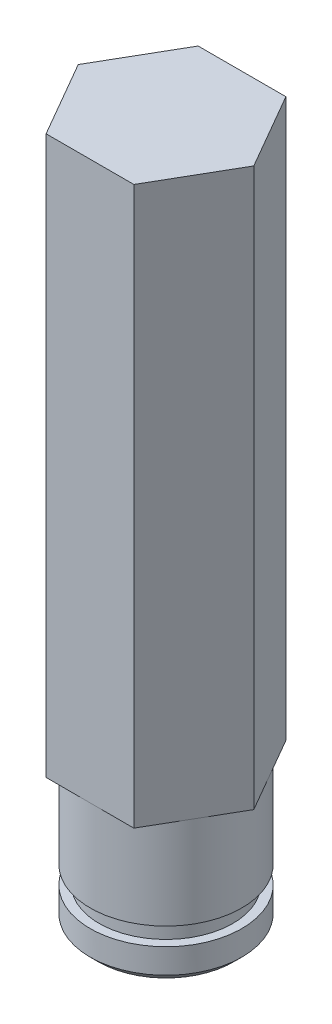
ISO-10303-21;
HEADER;
FILE_DESCRIPTION(('STEP AP214'),'2;1');
FILE_NAME('part.step','',(''),(''),'','','');
FILE_SCHEMA(('AUTOMOTIVE_DESIGN { 1 0 10303 214 1 1 1 1 }'));
ENDSEC;
DATA;
#1=APPLICATION_CONTEXT('core data for automotive mechanical design processes');
#2=APPLICATION_PROTOCOL_DEFINITION('international standard','automotive_design',2000,#1);
#3=PRODUCT_CONTEXT('',#1,'mechanical');
#4=PRODUCT('Part','Part','',(#3));
#5=PRODUCT_RELATED_PRODUCT_CATEGORY('part','',(#4));
#6=PRODUCT_DEFINITION_FORMATION('','',#4);
#7=PRODUCT_DEFINITION_CONTEXT('part definition',#1,'design');
#8=PRODUCT_DEFINITION('design','',#6,#7);
#9=PRODUCT_DEFINITION_SHAPE('','',#8);
#10=(LENGTH_UNIT() NAMED_UNIT(*) SI_UNIT(.MILLI.,.METRE.));
#11=(NAMED_UNIT(*) PLANE_ANGLE_UNIT() SI_UNIT($,.RADIAN.));
#12=(NAMED_UNIT(*) SI_UNIT($,.STERADIAN.) SOLID_ANGLE_UNIT());
#13=UNCERTAINTY_MEASURE_WITH_UNIT(LENGTH_MEASURE(1.E-05),#10,'distance_accuracy_value','');
#14=(GEOMETRIC_REPRESENTATION_CONTEXT(3) GLOBAL_UNCERTAINTY_ASSIGNED_CONTEXT((#13)) GLOBAL_UNIT_ASSIGNED_CONTEXT((#10,
#11,#12)) REPRESENTATION_CONTEXT('',''));
#15=CARTESIAN_POINT('',(0.,0.,0.));
#16=DIRECTION('',(0.,0.,1.));
#17=DIRECTION('',(1.,0.,0.));
#18=AXIS2_PLACEMENT_3D('',#15,#16,#17);
#19=CARTESIAN_POINT('',(-39.2241243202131,-43.815,-16.6661167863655));
#20=DIRECTION('',(0.,1.,0.));
#21=DIRECTION('',(0.,0.,1.));
#22=AXIS2_PLACEMENT_3D('',#19,#20,#21);
#23=PLANE('',#22);
#24=CARTESIAN_POINT('',(-39.2241243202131,-43.8149999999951,-16.6661167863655));
#25=DIRECTION('',(0.,1.,0.));
#26=DIRECTION('',(0.,0.,1.));
#27=AXIS2_PLACEMENT_3D('',#24,#25,#26);
#28=CIRCLE('',#27,4.24180000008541);
#29=CARTESIAN_POINT('',(-39.2241243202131,-43.8149999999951,-12.4243167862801));
#30=VERTEX_POINT('',#29);
#31=EDGE_CURVE('E20',#30,#30,#28,.T.);
#32=ORIENTED_EDGE('',*,*,#31,.F.);
#33=EDGE_LOOP('',(#32));
#34=FACE_BOUND('',#33,.T.);
#35=ADVANCED_FACE('F17',(#34),#23,.F.);
#36=CARTESIAN_POINT('',(-39.2241243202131,-43.3070000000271,-16.6661167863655));
#37=DIRECTION('',(0.,1.,0.));
#38=DIRECTION('',(0.,0.,1.));
#39=AXIS2_PLACEMENT_3D('',#36,#37,#38);
#40=CONICAL_SURFACE('',#39,4.74980000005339,0.785398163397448);
#41=CARTESIAN_POINT('',(-39.2241243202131,-43.307,-16.6661167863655));
#42=DIRECTION('',(0.,-1.,0.));
#43=DIRECTION('',(0.,0.,-1.));
#44=AXIS2_PLACEMENT_3D('',#41,#42,#43);
#45=CIRCLE('',#44,4.7498);
#46=CARTESIAN_POINT('',(-39.2241243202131,-43.307,-21.4159167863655));
#47=VERTEX_POINT('',#46);
#48=EDGE_CURVE('E98',#47,#47,#45,.F.);
#49=ORIENTED_EDGE('',*,*,#48,.F.);
#50=EDGE_LOOP('',(#49));
#51=FACE_BOUND('',#50,.T.);
#52=ORIENTED_EDGE('',*,*,#31,.T.);
#53=EDGE_LOOP('',(#52));
#54=FACE_BOUND('',#53,.T.);
#55=ADVANCED_FACE('F123',(#51,#54),#40,.T.);
#56=CARTESIAN_POINT('',(-39.2241243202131,-43.815,-16.6661167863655));
#57=DIRECTION('',(0.,-1.,0.));
#58=DIRECTION('',(0.,0.,-1.));
#59=AXIS2_PLACEMENT_3D('',#56,#57,#58);
#60=CYLINDRICAL_SURFACE('',#59,4.7498);
#61=CARTESIAN_POINT('',(-39.2241243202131,-41.7576,-16.6661167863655));
#62=DIRECTION('',(0.,-1.,0.));
#63=DIRECTION('',(0.,0.,-1.));
#64=AXIS2_PLACEMENT_3D('',#61,#62,#63);
#65=CIRCLE('',#64,4.7498);
#66=CARTESIAN_POINT('',(-39.2241243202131,-41.7576,-21.4159167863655));
#67=VERTEX_POINT('',#66);
#68=EDGE_CURVE('E101',#67,#67,#65,.F.);
#69=ORIENTED_EDGE('',*,*,#68,.F.);
#70=EDGE_LOOP('',(#69));
#71=FACE_BOUND('',#70,.T.);
#72=ORIENTED_EDGE('',*,*,#48,.T.);
#73=EDGE_LOOP('',(#72));
#74=FACE_BOUND('',#73,.T.);
#75=ADVANCED_FACE('F120',(#71,#74),#60,.T.);
#76=CARTESIAN_POINT('',(-43.4151243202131,-41.7576,-16.6661167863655));
#77=DIRECTION('',(0.,1.,0.));
#78=DIRECTION('',(0.,0.,1.));
#79=AXIS2_PLACEMENT_3D('',#76,#77,#78);
#80=PLANE('',#79);
#81=CARTESIAN_POINT('',(-39.2241243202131,-41.7576,-16.6661167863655));
#82=DIRECTION('',(0.,-1.,0.));
#83=DIRECTION('',(0.,0.,-1.));
#84=AXIS2_PLACEMENT_3D('',#81,#82,#83);
#85=CIRCLE('',#84,4.19100000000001);
#86=CARTESIAN_POINT('',(-39.2241243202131,-41.7576,-20.8571167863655));
#87=VERTEX_POINT('',#86);
#88=EDGE_CURVE('E113',#87,#87,#85,.F.);
#89=ORIENTED_EDGE('',*,*,#88,.F.);
#90=EDGE_LOOP('',(#89));
#91=FACE_BOUND('',#90,.T.);
#92=ORIENTED_EDGE('',*,*,#68,.T.);
#93=EDGE_LOOP('',(#92));
#94=FACE_BOUND('',#93,.T.);
#95=ADVANCED_FACE('F118',(#91,#94),#80,.T.);
#96=CARTESIAN_POINT('',(-39.2241243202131,-34.925,-16.6661167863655));
#97=DIRECTION('',(0.,-1.,0.));
#98=DIRECTION('',(0.,0.,-1.));
#99=AXIS2_PLACEMENT_3D('',#96,#97,#98);
#100=CYLINDRICAL_SURFACE('',#99,4.19100000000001);
#101=CARTESIAN_POINT('',(-39.2241243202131,-40.64,-16.6661167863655));
#102=DIRECTION('',(0.,-1.,0.));
#103=DIRECTION('',(0.,0.,-1.));
#104=AXIS2_PLACEMENT_3D('',#101,#102,#103);
#105=CIRCLE('',#104,4.19100000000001);
#106=CARTESIAN_POINT('',(-39.2241243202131,-40.64,-20.8571167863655));
#107=VERTEX_POINT('',#106);
#108=EDGE_CURVE('E110',#107,#107,#105,.F.);
#109=ORIENTED_EDGE('',*,*,#108,.F.);
#110=EDGE_LOOP('',(#109));
#111=FACE_BOUND('',#110,.T.);
#112=ORIENTED_EDGE('',*,*,#88,.T.);
#113=EDGE_LOOP('',(#112));
#114=FACE_BOUND('',#113,.T.);
#115=ADVANCED_FACE('F172',(#111,#114),#100,.T.);
#116=CARTESIAN_POINT('',(-48.1119346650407,-40.64,-16.6661167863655));
#117=DIRECTION('',(0.,-1.,0.));
#118=DIRECTION('',(0.,0.,-1.));
#119=AXIS2_PLACEMENT_3D('',#116,#117,#118);
#120=PLANE('',#119);
#121=CARTESIAN_POINT('',(-39.2241243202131,-40.64,-16.6661167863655));
#122=DIRECTION('',(0.,-1.,0.));
#123=DIRECTION('',(0.,0.,-1.));
#124=AXIS2_PLACEMENT_3D('',#121,#122,#123);
#125=CIRCLE('',#124,4.7498);
#126=CARTESIAN_POINT('',(-39.2241243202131,-40.64,-21.4159167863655));
#127=VERTEX_POINT('',#126);
#128=EDGE_CURVE('E86',#127,#127,#125,.F.);
#129=ORIENTED_EDGE('',*,*,#128,.F.);
#130=EDGE_LOOP('',(#129));
#131=FACE_BOUND('',#130,.T.);
#132=ORIENTED_EDGE('',*,*,#108,.T.);
#133=EDGE_LOOP('',(#132));
#134=FACE_BOUND('',#133,.T.);
#135=ADVANCED_FACE('F168',(#131,#134),#120,.T.);
#136=CARTESIAN_POINT('',(-39.2241243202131,-43.815,-16.6661167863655));
#137=DIRECTION('',(0.,-1.,0.));
#138=DIRECTION('',(0.,0.,-1.));
#139=AXIS2_PLACEMENT_3D('',#136,#137,#138);
#140=CYLINDRICAL_SURFACE('',#139,4.7498);
#141=ORIENTED_EDGE('',*,*,#128,.T.);
#142=EDGE_LOOP('',(#141));
#143=FACE_BOUND('',#142,.T.);
#144=CARTESIAN_POINT('',(-39.2241243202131,-34.925,-16.6661167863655));
#145=DIRECTION('',(0.,-1.,0.));
#146=DIRECTION('',(0.,0.,-1.));
#147=AXIS2_PLACEMENT_3D('',#144,#145,#146);
#148=CIRCLE('',#147,4.7498);
#149=CARTESIAN_POINT('',(-39.2241243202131,-34.925,-21.4159167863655));
#150=VERTEX_POINT('',#149);
#151=EDGE_CURVE('E104',#150,#150,#148,.F.);
#152=ORIENTED_EDGE('',*,*,#151,.F.);
#153=EDGE_LOOP('',(#152));
#154=FACE_BOUND('',#153,.T.);
#155=ADVANCED_FACE('F165',(#143,#154),#140,.T.);
#156=CARTESIAN_POINT('',(-41.9737549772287,-34.925,-21.4286167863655));
#157=DIRECTION('',(-0.866025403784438,0.,-0.500000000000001));
#158=DIRECTION('',(-0.500000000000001,0.,0.866025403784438));
#159=AXIS2_PLACEMENT_3D('',#156,#157,#158);
#160=PLANE('',#159);
#161=DIRECTION('',(0.500000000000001,0.,-0.866025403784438));
#162=VECTOR('',#161,1.);
#163=CARTESIAN_POINT('',(-44.7233856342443,-34.925,-16.6661167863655));
#164=LINE('',#163,#162);
#165=CARTESIAN_POINT('',(-44.7233856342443,-34.925,-16.6661167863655));
#166=VERTEX_POINT('',#165);
#167=CARTESIAN_POINT('',(-41.9737549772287,-34.925,-21.4286167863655));
#168=VERTEX_POINT('',#167);
#169=EDGE_CURVE('E256',#166,#168,#164,.T.);
#170=ORIENTED_EDGE('',*,*,#169,.F.);
#171=DIRECTION('',(0.,1.,0.));
#172=VECTOR('',#171,1.);
#173=CARTESIAN_POINT('',(-44.7233856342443,-34.925,-16.6661167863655));
#174=LINE('',#173,#172);
#175=CARTESIAN_POINT('',(-44.7233856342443,0.,-16.6661167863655));
#176=VERTEX_POINT('',#175);
#177=EDGE_CURVE('E77',#176,#166,#174,.F.);
#178=ORIENTED_EDGE('',*,*,#177,.F.);
#179=DIRECTION('',(0.500000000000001,0.,-0.866025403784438));
#180=VECTOR('',#179,1.);
#181=CARTESIAN_POINT('',(-44.7233856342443,0.,-16.6661167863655));
#182=LINE('',#181,#180);
#183=CARTESIAN_POINT('',(-41.9737549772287,0.,-21.4286167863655));
#184=VERTEX_POINT('',#183);
#185=EDGE_CURVE('E72',#176,#184,#182,.T.);
#186=ORIENTED_EDGE('',*,*,#185,.T.);
#187=DIRECTION('',(0.,1.,0.));
#188=VECTOR('',#187,1.);
#189=CARTESIAN_POINT('',(-41.9737549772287,-34.925,-21.4286167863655));
#190=LINE('',#189,#188);
#191=EDGE_CURVE('E75',#168,#184,#190,.T.);
#192=ORIENTED_EDGE('',*,*,#191,.F.);
#193=EDGE_LOOP('',(#170,#178,#186,#192));
#194=FACE_BOUND('',#193,.T.);
#195=ADVANCED_FACE('F74',(#194),#160,.T.);
#196=CARTESIAN_POINT('',(-36.4744936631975,-34.925,-21.4286167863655));
#197=DIRECTION('',(0.,0.,-1.));
#198=DIRECTION('',(-1.,0.,0.));
#199=AXIS2_PLACEMENT_3D('',#196,#197,#198);
#200=PLANE('',#199);
#201=DIRECTION('',(1.,0.,0.));
#202=VECTOR('',#201,1.);
#203=CARTESIAN_POINT('',(-44.7233856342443,-34.925,-21.4286167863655));
#204=LINE('',#203,#202);
#205=CARTESIAN_POINT('',(-36.4744936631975,-34.925,-21.4286167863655));
#206=VERTEX_POINT('',#205);
#207=EDGE_CURVE('E84',#168,#206,#204,.T.);
#208=ORIENTED_EDGE('',*,*,#207,.F.);
#209=ORIENTED_EDGE('',*,*,#191,.T.);
#210=DIRECTION('',(1.,0.,0.));
#211=VECTOR('',#210,1.);
#212=CARTESIAN_POINT('',(-44.7233856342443,0.,-21.4286167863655));
#213=LINE('',#212,#211);
#214=CARTESIAN_POINT('',(-36.4744936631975,0.,-21.4286167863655));
#215=VERTEX_POINT('',#214);
#216=EDGE_CURVE('E67',#184,#215,#213,.T.);
#217=ORIENTED_EDGE('',*,*,#216,.T.);
#218=DIRECTION('',(0.,1.,0.));
#219=VECTOR('',#218,1.);
#220=CARTESIAN_POINT('',(-36.4744936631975,-34.925,-21.4286167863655));
#221=LINE('',#220,#219);
#222=EDGE_CURVE('E80',#206,#215,#221,.T.);
#223=ORIENTED_EDGE('',*,*,#222,.F.);
#224=EDGE_LOOP('',(#208,#209,#217,#223));
#225=FACE_BOUND('',#224,.T.);
#226=ADVANCED_FACE('F82',(#225),#200,.T.);
#227=CARTESIAN_POINT('',(-33.7248630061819,-34.925,-16.6661167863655));
#228=DIRECTION('',(0.866025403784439,0.,-0.5));
#229=DIRECTION('',(-0.5,0.,-0.866025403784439));
#230=AXIS2_PLACEMENT_3D('',#227,#228,#229);
#231=PLANE('',#230);
#232=DIRECTION('',(0.500000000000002,0.,0.866025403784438));
#233=VECTOR('',#232,1.);
#234=CARTESIAN_POINT('',(-36.4744936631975,-34.925,-21.4286167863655));
#235=LINE('',#234,#233);
#236=CARTESIAN_POINT('',(-33.7248630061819,-34.925,-16.6661167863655));
#237=VERTEX_POINT('',#236);
#238=EDGE_CURVE('E250',#206,#237,#235,.T.);
#239=ORIENTED_EDGE('',*,*,#238,.F.);
#240=ORIENTED_EDGE('',*,*,#222,.T.);
#241=DIRECTION('',(0.500000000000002,0.,0.866025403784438));
#242=VECTOR('',#241,1.);
#243=CARTESIAN_POINT('',(-36.4744936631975,0.,-21.4286167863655));
#244=LINE('',#243,#242);
#245=CARTESIAN_POINT('',(-33.7248630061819,0.,-16.6661167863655));
#246=VERTEX_POINT('',#245);
#247=EDGE_CURVE('E91',#215,#246,#244,.T.);
#248=ORIENTED_EDGE('',*,*,#247,.T.);
#249=DIRECTION('',(0.,1.,0.));
#250=VECTOR('',#249,1.);
#251=CARTESIAN_POINT('',(-33.7248630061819,-34.925,-16.6661167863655));
#252=LINE('',#251,#250);
#253=EDGE_CURVE('E252',#237,#246,#252,.T.);
#254=ORIENTED_EDGE('',*,*,#253,.F.);
#255=EDGE_LOOP('',(#239,#240,#248,#254));
#256=FACE_BOUND('',#255,.T.);
#257=ADVANCED_FACE('F157',(#256),#231,.T.);
#258=CARTESIAN_POINT('',(-44.7233856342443,0.,-16.6661167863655));
#259=DIRECTION('',(0.,-1.,0.));
#260=DIRECTION('',(0.,0.,-1.));
#261=AXIS2_PLACEMENT_3D('',#258,#259,#260);
#262=PLANE('',#261);
#263=DIRECTION('',(1.,0.,0.));
#264=VECTOR('',#263,1.);
#265=CARTESIAN_POINT('',(-41.9737549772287,0.,-11.9036167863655));
#266=LINE('',#265,#264);
#267=CARTESIAN_POINT('',(-36.4744936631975,0.,-11.9036167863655));
#268=VERTEX_POINT('',#267);
#269=CARTESIAN_POINT('',(-41.9737549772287,0.,-11.9036167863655));
#270=VERTEX_POINT('',#269);
#271=EDGE_CURVE('E266',#268,#270,#266,.F.);
#272=ORIENTED_EDGE('',*,*,#271,.F.);
#273=DIRECTION('',(0.500000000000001,0.,-0.866025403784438));
#274=VECTOR('',#273,1.);
#275=CARTESIAN_POINT('',(-36.4744936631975,0.,-11.9036167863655));
#276=LINE('',#275,#274);
#277=EDGE_CURVE('E253',#246,#268,#276,.F.);
#278=ORIENTED_EDGE('',*,*,#277,.F.);
#279=ORIENTED_EDGE('',*,*,#247,.F.);
#280=ORIENTED_EDGE('',*,*,#216,.F.);
#281=ORIENTED_EDGE('',*,*,#185,.F.);
#282=DIRECTION('',(0.5,0.,0.866025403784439));
#283=VECTOR('',#282,1.);
#284=CARTESIAN_POINT('',(-44.7233856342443,0.,-16.6661167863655));
#285=LINE('',#284,#283);
#286=EDGE_CURVE('E93',#270,#176,#285,.F.);
#287=ORIENTED_EDGE('',*,*,#286,.F.);
#288=EDGE_LOOP('',(#272,#278,#279,#280,#281,#287));
#289=FACE_BOUND('',#288,.T.);
#290=ADVANCED_FACE('F89',(#289),#262,.F.);
#291=CARTESIAN_POINT('',(-44.7233856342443,-34.925,-16.6661167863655));
#292=DIRECTION('',(-0.866025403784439,0.,0.5));
#293=DIRECTION('',(0.5,0.,0.866025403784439));
#294=AXIS2_PLACEMENT_3D('',#291,#292,#293);
#295=PLANE('',#294);
#296=DIRECTION('',(-0.500000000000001,0.,-0.866025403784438));
#297=VECTOR('',#296,1.);
#298=CARTESIAN_POINT('',(-41.9737549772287,-34.925,-11.9036167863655));
#299=LINE('',#298,#297);
#300=CARTESIAN_POINT('',(-41.9737549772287,-34.925,-11.9036167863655));
#301=VERTEX_POINT('',#300);
#302=EDGE_CURVE('E107',#301,#166,#299,.T.);
#303=ORIENTED_EDGE('',*,*,#302,.F.);
#304=DIRECTION('',(0.,1.,0.));
#305=VECTOR('',#304,1.);
#306=CARTESIAN_POINT('',(-41.9737549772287,-34.925,-11.9036167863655));
#307=LINE('',#306,#305);
#308=EDGE_CURVE('E264',#270,#301,#307,.F.);
#309=ORIENTED_EDGE('',*,*,#308,.F.);
#310=ORIENTED_EDGE('',*,*,#286,.T.);
#311=ORIENTED_EDGE('',*,*,#177,.T.);
#312=EDGE_LOOP('',(#303,#309,#310,#311));
#313=FACE_BOUND('',#312,.T.);
#314=ADVANCED_FACE('F151',(#313),#295,.T.);
#315=CARTESIAN_POINT('',(-44.7233856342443,-34.925,-16.6661167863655));
#316=DIRECTION('',(0.,-1.,0.));
#317=DIRECTION('',(0.,0.,-1.));
#318=AXIS2_PLACEMENT_3D('',#315,#316,#317);
#319=PLANE('',#318);
#320=DIRECTION('',(0.500000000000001,0.,-0.866025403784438));
#321=VECTOR('',#320,1.);
#322=CARTESIAN_POINT('',(-36.4744936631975,-34.925,-11.9036167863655));
#323=LINE('',#322,#321);
#324=CARTESIAN_POINT('',(-36.4744936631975,-34.925,-11.9036167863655));
#325=VERTEX_POINT('',#324);
#326=EDGE_CURVE('E35',#325,#237,#323,.T.);
#327=ORIENTED_EDGE('',*,*,#326,.F.);
#328=DIRECTION('',(1.,0.,0.));
#329=VECTOR('',#328,1.);
#330=CARTESIAN_POINT('',(-41.9737549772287,-34.925,-11.9036167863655));
#331=LINE('',#330,#329);
#332=EDGE_CURVE('E26',#301,#325,#331,.T.);
#333=ORIENTED_EDGE('',*,*,#332,.F.);
#334=ORIENTED_EDGE('',*,*,#302,.T.);
#335=ORIENTED_EDGE('',*,*,#169,.T.);
#336=ORIENTED_EDGE('',*,*,#207,.T.);
#337=ORIENTED_EDGE('',*,*,#238,.T.);
#338=EDGE_LOOP('',(#327,#333,#334,#335,#336,#337));
#339=FACE_BOUND('',#338,.T.);
#340=ORIENTED_EDGE('',*,*,#151,.T.);
#341=EDGE_LOOP('',(#340));
#342=FACE_BOUND('',#341,.T.);
#343=ADVANCED_FACE('F144',(#339,#342),#319,.T.);
#344=CARTESIAN_POINT('',(-36.4744936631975,-34.925,-11.9036167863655));
#345=DIRECTION('',(0.866025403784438,0.,0.500000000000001));
#346=DIRECTION('',(0.500000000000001,0.,-0.866025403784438));
#347=AXIS2_PLACEMENT_3D('',#344,#345,#346);
#348=PLANE('',#347);
#349=ORIENTED_EDGE('',*,*,#326,.T.);
#350=ORIENTED_EDGE('',*,*,#253,.T.);
#351=ORIENTED_EDGE('',*,*,#277,.T.);
#352=DIRECTION('',(0.,1.,0.));
#353=VECTOR('',#352,1.);
#354=CARTESIAN_POINT('',(-36.4744936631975,-34.925,-11.9036167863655));
#355=LINE('',#354,#353);
#356=EDGE_CURVE('E11',#325,#268,#355,.T.);
#357=ORIENTED_EDGE('',*,*,#356,.F.);
#358=EDGE_LOOP('',(#349,#350,#351,#357));
#359=FACE_BOUND('',#358,.T.);
#360=ADVANCED_FACE('F138',(#359),#348,.T.);
#361=CARTESIAN_POINT('',(-41.9737549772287,-34.925,-11.9036167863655));
#362=DIRECTION('',(0.,0.,1.));
#363=DIRECTION('',(1.,0.,0.));
#364=AXIS2_PLACEMENT_3D('',#361,#362,#363);
#365=PLANE('',#364);
#366=ORIENTED_EDGE('',*,*,#332,.T.);
#367=ORIENTED_EDGE('',*,*,#356,.T.);
#368=ORIENTED_EDGE('',*,*,#271,.T.);
#369=ORIENTED_EDGE('',*,*,#308,.T.);
#370=EDGE_LOOP('',(#366,#367,#368,#369));
#371=FACE_BOUND('',#370,.T.);
#372=ADVANCED_FACE('F136',(#371),#365,.T.);
#373=CLOSED_SHELL('',(#35,#55,#75,#95,#115,#135,#155,#195,#226,#257,#290,#314,#343,#360,#372));
#374=MANIFOLD_SOLID_BREP('B1',#373);
#375=ADVANCED_BREP_SHAPE_REPRESENTATION('',(#18,#374),#14);
#376=SHAPE_DEFINITION_REPRESENTATION(#9,#375);
ENDSEC;
END-ISO-10303-21;
